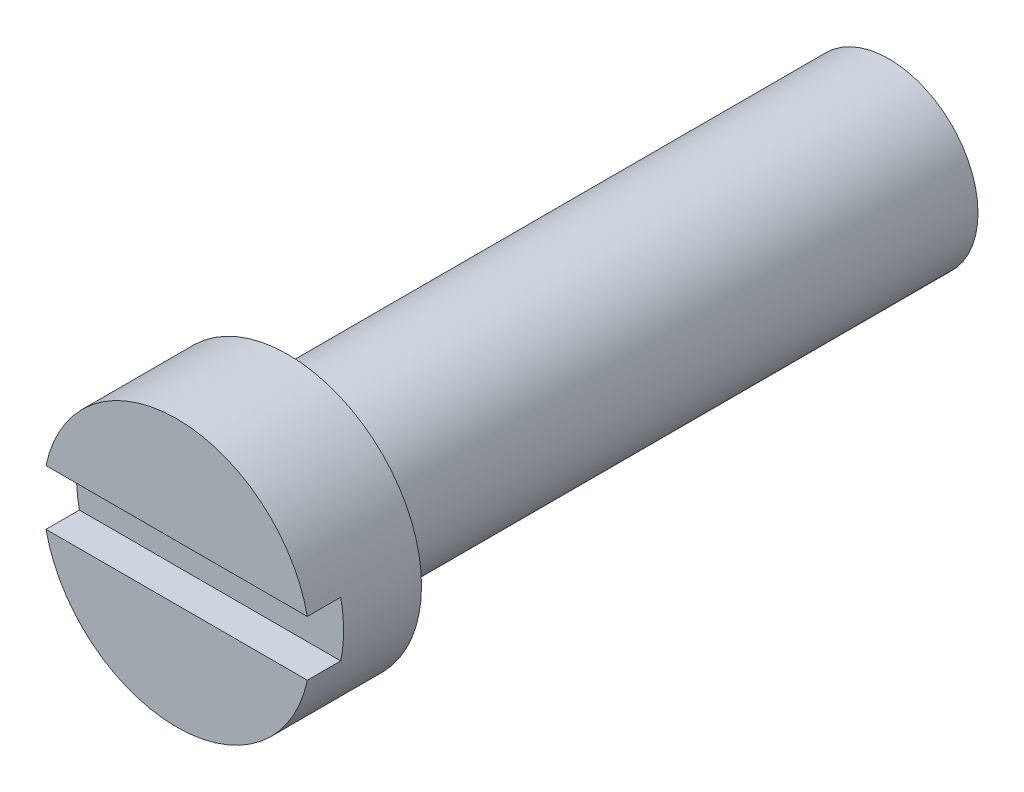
from build123d import *

# Parameters (mm, degrees)
SKETCH1_R          = 4
EXTRUDE1_DEPTH     = 27
SKETCH2_R          = 6
EXTRUDE2_DEPTH     = 5
CUT_EXTRUDE1_START = -1.5
CUT_EXTRUDE1_DEPTH = 1.5


with BuildPart() as part:
    # Sketch1 → Extrude1 (new body)
    with BuildSketch(Plane.XY):
        with Locations((35, 0)):
            Circle(SKETCH1_R)
    extrude(amount=-EXTRUDE1_DEPTH)

    # Sketch2 → Extrude2 (add)
    with BuildSketch(Plane.XY):
        with Locations((35, 0)):
            Circle(SKETCH2_R)
    extrude(amount=EXTRUDE2_DEPTH)

    # Sketch3 → Cut-Extrude1 (cut)
    with BuildSketch(Plane.XY.offset(5).offset(CUT_EXTRUDE1_START)):
        with BuildLine():
            Line((29.129487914, 1.239793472), (40.870512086, 1.239793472))
            ThreePointArc((40.870512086, 1.239793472), (41, 0), (40.870512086, -1.239793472))
            Line((40.870512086, -1.239793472), (29.129487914, -1.239793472))
            ThreePointArc((29.129487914, -1.239793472), (29, 0), (29.129487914, 1.239793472))
        make_face()
    extrude(amount=CUT_EXTRUDE1_DEPTH, mode=Mode.SUBTRACT)


solid = part.part
